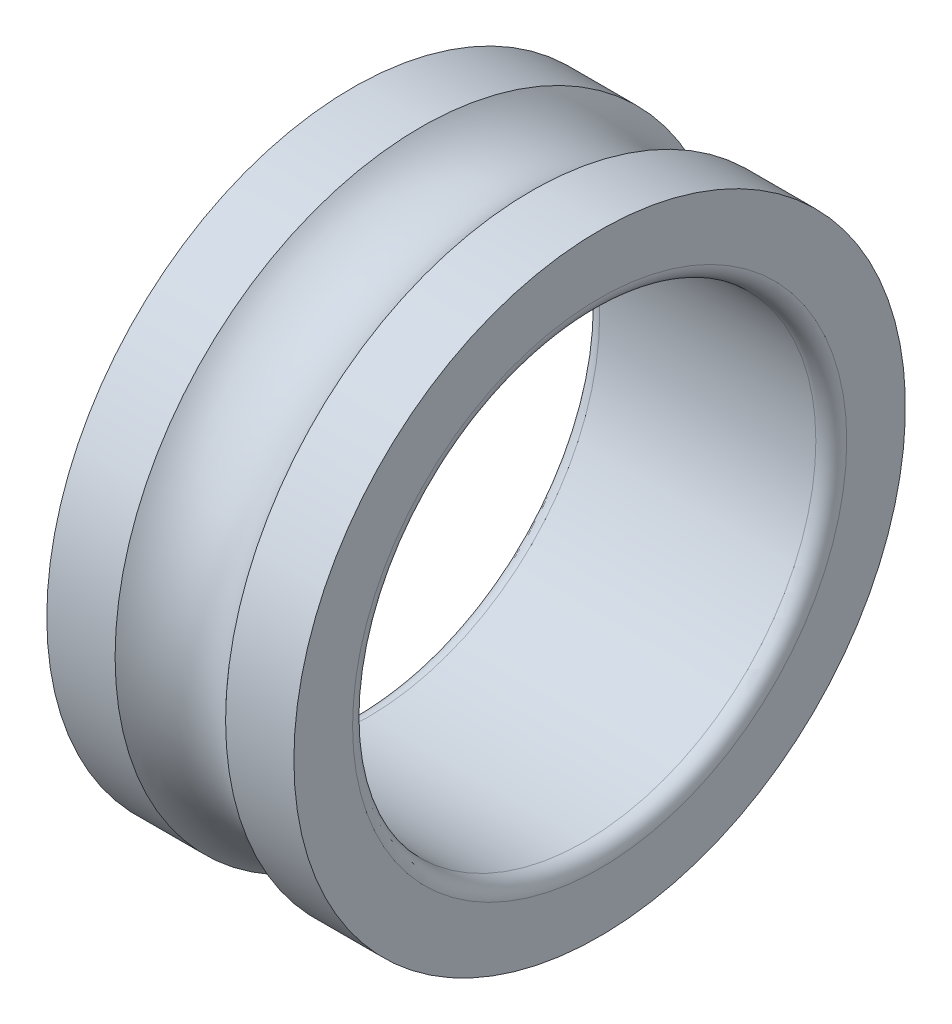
ISO-10303-21;
HEADER;
FILE_DESCRIPTION(('STEP AP214'),'2;1');
FILE_NAME('part.step','',(''),(''),'','','');
FILE_SCHEMA(('AUTOMOTIVE_DESIGN { 1 0 10303 214 1 1 1 1 }'));
ENDSEC;
DATA;
#1=APPLICATION_CONTEXT('core data for automotive mechanical design processes');
#2=APPLICATION_PROTOCOL_DEFINITION('international standard','automotive_design',2000,#1);
#3=PRODUCT_CONTEXT('',#1,'mechanical');
#4=PRODUCT('Part','Part','',(#3));
#5=PRODUCT_RELATED_PRODUCT_CATEGORY('part','',(#4));
#6=PRODUCT_DEFINITION_FORMATION('','',#4);
#7=PRODUCT_DEFINITION_CONTEXT('part definition',#1,'design');
#8=PRODUCT_DEFINITION('design','',#6,#7);
#9=PRODUCT_DEFINITION_SHAPE('','',#8);
#10=(LENGTH_UNIT() NAMED_UNIT(*) SI_UNIT(.MILLI.,.METRE.));
#11=(NAMED_UNIT(*) PLANE_ANGLE_UNIT() SI_UNIT($,.RADIAN.));
#12=(NAMED_UNIT(*) SI_UNIT($,.STERADIAN.) SOLID_ANGLE_UNIT());
#13=UNCERTAINTY_MEASURE_WITH_UNIT(LENGTH_MEASURE(1.E-05),#10,'distance_accuracy_value','');
#14=(GEOMETRIC_REPRESENTATION_CONTEXT(3) GLOBAL_UNCERTAINTY_ASSIGNED_CONTEXT((#13)) GLOBAL_UNIT_ASSIGNED_CONTEXT((#10,
#11,#12)) REPRESENTATION_CONTEXT('',''));
#15=CARTESIAN_POINT('',(0.,0.,0.));
#16=DIRECTION('',(0.,0.,1.));
#17=DIRECTION('',(1.,0.,0.));
#18=AXIS2_PLACEMENT_3D('',#15,#16,#17);
#19=CARTESIAN_POINT('',(1.,0.,0.));
#20=DIRECTION('',(-1.,0.,0.));
#21=DIRECTION('',(0.,0.,1.));
#22=AXIS2_PLACEMENT_3D('',#19,#20,#21);
#23=TOROIDAL_SURFACE('',#22,16.,1.);
#24=CARTESIAN_POINT('',(1.,0.,0.));
#25=DIRECTION('',(-1.,0.,0.));
#26=DIRECTION('',(0.,0.,1.));
#27=AXIS2_PLACEMENT_3D('',#24,#25,#26);
#28=CIRCLE('',#27,15.);
#29=CARTESIAN_POINT('',(1.,0.,15.));
#30=VERTEX_POINT('',#29);
#31=EDGE_CURVE('E10',#30,#30,#28,.T.);
#32=ORIENTED_EDGE('',*,*,#31,.F.);
#33=EDGE_LOOP('',(#32));
#34=FACE_BOUND('',#33,.T.);
#35=CARTESIAN_POINT('',(0.,0.,0.));
#36=DIRECTION('',(-1.,0.,0.));
#37=DIRECTION('',(0.,0.,1.));
#38=AXIS2_PLACEMENT_3D('',#35,#36,#37);
#39=CIRCLE('',#38,16.);
#40=CARTESIAN_POINT('',(0.,0.,16.));
#41=VERTEX_POINT('',#40);
#42=EDGE_CURVE('E57',#41,#41,#39,.T.);
#43=ORIENTED_EDGE('',*,*,#42,.T.);
#44=EDGE_LOOP('',(#43));
#45=FACE_BOUND('',#44,.T.);
#46=ADVANCED_FACE('F29',(#34,#45),#23,.T.);
#47=CARTESIAN_POINT('',(0.,0.,0.));
#48=DIRECTION('',(-1.,0.,0.));
#49=DIRECTION('',(0.,0.,1.));
#50=AXIS2_PLACEMENT_3D('',#47,#48,#49);
#51=CYLINDRICAL_SURFACE('',#50,15.);
#52=CARTESIAN_POINT('',(15.,0.,0.));
#53=DIRECTION('',(-1.,0.,0.));
#54=DIRECTION('',(0.,0.,1.));
#55=AXIS2_PLACEMENT_3D('',#52,#53,#54);
#56=CIRCLE('',#55,15.);
#57=CARTESIAN_POINT('',(15.,0.,15.));
#58=VERTEX_POINT('',#57);
#59=EDGE_CURVE('E35',#58,#58,#56,.T.);
#60=ORIENTED_EDGE('',*,*,#59,.F.);
#61=EDGE_LOOP('',(#60));
#62=FACE_BOUND('',#61,.T.);
#63=ORIENTED_EDGE('',*,*,#31,.T.);
#64=EDGE_LOOP('',(#63));
#65=FACE_BOUND('',#64,.T.);
#66=ADVANCED_FACE('F94',(#62,#65),#51,.F.);
#67=CARTESIAN_POINT('',(15.,0.,0.));
#68=DIRECTION('',(-1.,0.,0.));
#69=DIRECTION('',(0.,0.,1.));
#70=AXIS2_PLACEMENT_3D('',#67,#68,#69);
#71=TOROIDAL_SURFACE('',#70,16.,0.999999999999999);
#72=CARTESIAN_POINT('',(16.,0.,0.));
#73=DIRECTION('',(-1.,0.,0.));
#74=DIRECTION('',(0.,0.,1.));
#75=AXIS2_PLACEMENT_3D('',#72,#73,#74);
#76=CIRCLE('',#75,16.);
#77=CARTESIAN_POINT('',(16.,0.,16.));
#78=VERTEX_POINT('',#77);
#79=EDGE_CURVE('E39',#78,#78,#76,.T.);
#80=ORIENTED_EDGE('',*,*,#79,.F.);
#81=EDGE_LOOP('',(#80));
#82=FACE_BOUND('',#81,.T.);
#83=ORIENTED_EDGE('',*,*,#59,.T.);
#84=EDGE_LOOP('',(#83));
#85=FACE_BOUND('',#84,.T.);
#86=ADVANCED_FACE('F89',(#82,#85),#71,.T.);
#87=CARTESIAN_POINT('',(16.,0.,-19.8));
#88=DIRECTION('',(-1.,0.,0.));
#89=DIRECTION('',(0.,0.,1.));
#90=AXIS2_PLACEMENT_3D('',#87,#88,#89);
#91=PLANE('',#90);
#92=CARTESIAN_POINT('',(16.,0.,0.));
#93=DIRECTION('',(-1.,0.,0.));
#94=DIRECTION('',(0.,0.,1.));
#95=AXIS2_PLACEMENT_3D('',#92,#93,#94);
#96=CIRCLE('',#95,19.8);
#97=CARTESIAN_POINT('',(16.,0.,19.8));
#98=VERTEX_POINT('',#97);
#99=EDGE_CURVE('E43',#98,#98,#96,.T.);
#100=ORIENTED_EDGE('',*,*,#99,.F.);
#101=EDGE_LOOP('',(#100));
#102=FACE_BOUND('',#101,.T.);
#103=ORIENTED_EDGE('',*,*,#79,.T.);
#104=EDGE_LOOP('',(#103));
#105=FACE_BOUND('',#104,.T.);
#106=ADVANCED_FACE('F83',(#102,#105),#91,.F.);
#107=CARTESIAN_POINT('',(0.,0.,0.));
#108=DIRECTION('',(-1.,0.,0.));
#109=DIRECTION('',(0.,0.,1.));
#110=AXIS2_PLACEMENT_3D('',#107,#108,#109);
#111=CYLINDRICAL_SURFACE('',#110,19.8);
#112=CARTESIAN_POINT('',(11.5777087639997,0.,0.));
#113=DIRECTION('',(-1.,0.,0.));
#114=DIRECTION('',(0.,0.,1.));
#115=AXIS2_PLACEMENT_3D('',#112,#113,#114);
#116=CIRCLE('',#115,19.8);
#117=CARTESIAN_POINT('',(11.5777087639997,0.,19.8));
#118=VERTEX_POINT('',#117);
#119=EDGE_CURVE('E48',#118,#118,#116,.T.);
#120=ORIENTED_EDGE('',*,*,#119,.F.);
#121=EDGE_LOOP('',(#120));
#122=FACE_BOUND('',#121,.T.);
#123=ORIENTED_EDGE('',*,*,#99,.T.);
#124=EDGE_LOOP('',(#123));
#125=FACE_BOUND('',#124,.T.);
#126=ADVANCED_FACE('F77',(#122,#125),#111,.T.);
#127=CARTESIAN_POINT('',(8.,0.,0.));
#128=DIRECTION('',(-1.,0.,0.));
#129=DIRECTION('',(0.,0.,1.));
#130=AXIS2_PLACEMENT_3D('',#127,#128,#129);
#131=TOROIDAL_SURFACE('',#130,23.,4.8);
#132=CARTESIAN_POINT('',(4.42229123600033,0.,0.));
#133=DIRECTION('',(-1.,0.,0.));
#134=DIRECTION('',(0.,0.,1.));
#135=AXIS2_PLACEMENT_3D('',#132,#133,#134);
#136=CIRCLE('',#135,19.8);
#137=CARTESIAN_POINT('',(4.42229123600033,0.,19.8));
#138=VERTEX_POINT('',#137);
#139=EDGE_CURVE('E51',#138,#138,#136,.T.);
#140=ORIENTED_EDGE('',*,*,#139,.F.);
#141=EDGE_LOOP('',(#140));
#142=FACE_BOUND('',#141,.T.);
#143=ORIENTED_EDGE('',*,*,#119,.T.);
#144=EDGE_LOOP('',(#143));
#145=FACE_BOUND('',#144,.T.);
#146=ADVANCED_FACE('F71',(#142,#145),#131,.F.);
#147=CARTESIAN_POINT('',(0.,0.,0.));
#148=DIRECTION('',(-1.,0.,0.));
#149=DIRECTION('',(0.,0.,1.));
#150=AXIS2_PLACEMENT_3D('',#147,#148,#149);
#151=CYLINDRICAL_SURFACE('',#150,19.8);
#152=CARTESIAN_POINT('',(0.,0.,0.));
#153=DIRECTION('',(-1.,0.,0.));
#154=DIRECTION('',(0.,0.,1.));
#155=AXIS2_PLACEMENT_3D('',#152,#153,#154);
#156=CIRCLE('',#155,19.8);
#157=CARTESIAN_POINT('',(0.,0.,19.8));
#158=VERTEX_POINT('',#157);
#159=EDGE_CURVE('E54',#158,#158,#156,.T.);
#160=ORIENTED_EDGE('',*,*,#159,.F.);
#161=EDGE_LOOP('',(#160));
#162=FACE_BOUND('',#161,.T.);
#163=ORIENTED_EDGE('',*,*,#139,.T.);
#164=EDGE_LOOP('',(#163));
#165=FACE_BOUND('',#164,.T.);
#166=ADVANCED_FACE('F65',(#162,#165),#151,.T.);
#167=CARTESIAN_POINT('',(0.,0.,-19.8));
#168=DIRECTION('',(1.,0.,0.));
#169=DIRECTION('',(0.,0.,-1.));
#170=AXIS2_PLACEMENT_3D('',#167,#168,#169);
#171=PLANE('',#170);
#172=ORIENTED_EDGE('',*,*,#42,.F.);
#173=EDGE_LOOP('',(#172));
#174=FACE_BOUND('',#173,.T.);
#175=ORIENTED_EDGE('',*,*,#159,.T.);
#176=EDGE_LOOP('',(#175));
#177=FACE_BOUND('',#176,.T.);
#178=ADVANCED_FACE('F62',(#174,#177),#171,.F.);
#179=CLOSED_SHELL('',(#46,#66,#86,#106,#126,#146,#166,#178));
#180=MANIFOLD_SOLID_BREP('B2',#179);
#181=ADVANCED_BREP_SHAPE_REPRESENTATION('',(#18,#180),#14);
#182=SHAPE_DEFINITION_REPRESENTATION(#9,#181);
ENDSEC;
END-ISO-10303-21;
